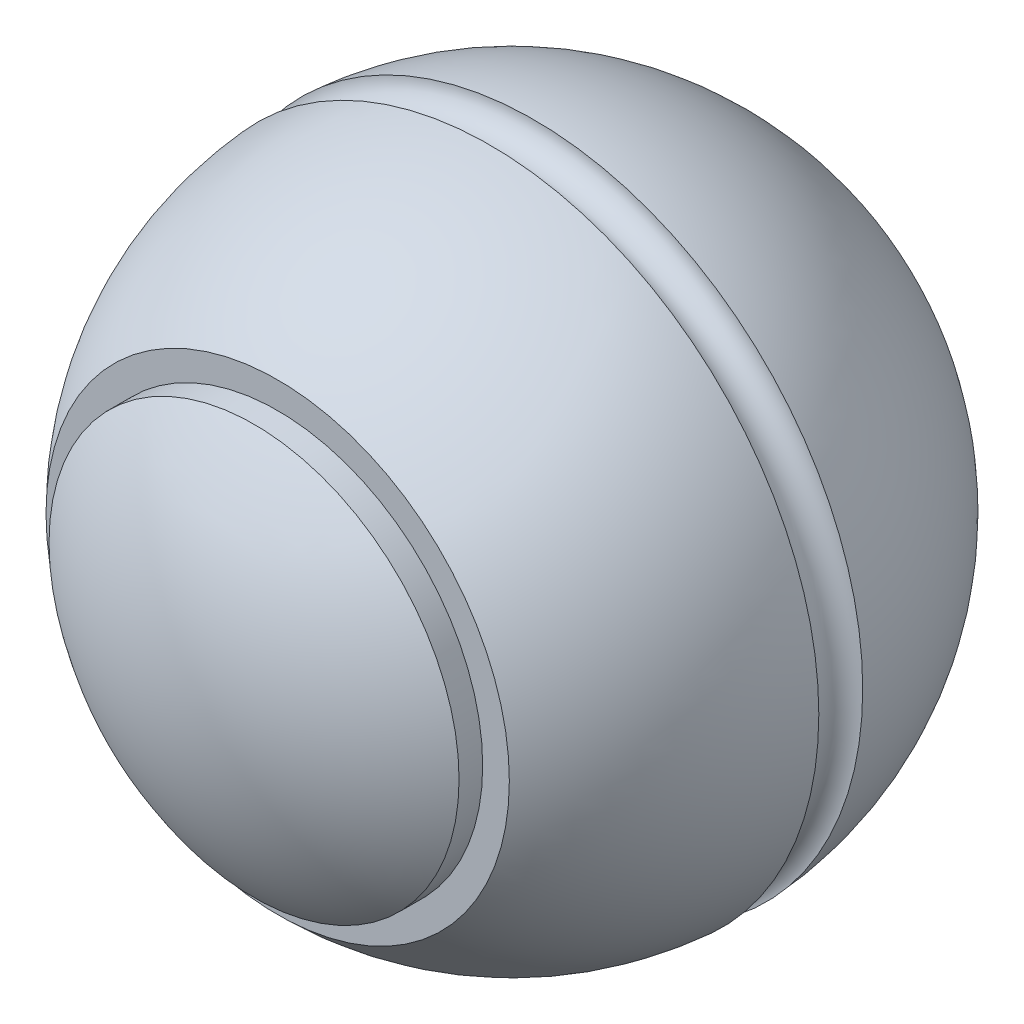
ISO-10303-21;
HEADER;
FILE_DESCRIPTION(('STEP AP214'),'2;1');
FILE_NAME('part.step','',(''),(''),'','','');
FILE_SCHEMA(('AUTOMOTIVE_DESIGN { 1 0 10303 214 1 1 1 1 }'));
ENDSEC;
DATA;
#1=APPLICATION_CONTEXT('core data for automotive mechanical design processes');
#2=APPLICATION_PROTOCOL_DEFINITION('international standard','automotive_design',2000,#1);
#3=PRODUCT_CONTEXT('',#1,'mechanical');
#4=PRODUCT('Part','Part','',(#3));
#5=PRODUCT_RELATED_PRODUCT_CATEGORY('part','',(#4));
#6=PRODUCT_DEFINITION_FORMATION('','',#4);
#7=PRODUCT_DEFINITION_CONTEXT('part definition',#1,'design');
#8=PRODUCT_DEFINITION('design','',#6,#7);
#9=PRODUCT_DEFINITION_SHAPE('','',#8);
#10=(LENGTH_UNIT() NAMED_UNIT(*) SI_UNIT(.MILLI.,.METRE.));
#11=(NAMED_UNIT(*) PLANE_ANGLE_UNIT() SI_UNIT($,.RADIAN.));
#12=(NAMED_UNIT(*) SI_UNIT($,.STERADIAN.) SOLID_ANGLE_UNIT());
#13=UNCERTAINTY_MEASURE_WITH_UNIT(LENGTH_MEASURE(1.E-05),#10,'distance_accuracy_value','');
#14=(GEOMETRIC_REPRESENTATION_CONTEXT(3) GLOBAL_UNCERTAINTY_ASSIGNED_CONTEXT((#13)) GLOBAL_UNIT_ASSIGNED_CONTEXT((#10,
#11,#12)) REPRESENTATION_CONTEXT('',''));
#15=CARTESIAN_POINT('',(0.,0.,0.));
#16=DIRECTION('',(0.,0.,1.));
#17=DIRECTION('',(1.,0.,0.));
#18=AXIS2_PLACEMENT_3D('',#15,#16,#17);
#19=CARTESIAN_POINT('',(0.,0.,19.8997487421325));
#20=DIRECTION('',(-1.,0.,0.));
#21=DIRECTION('',(0.,0.,1.));
#22=AXIS2_PLACEMENT_3D('',#19,#20,#21);
#23=SPHERICAL_SURFACE('',#22,22.5);
#24=CARTESIAN_POINT('',(0.,0.,19.8997487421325));
#25=DIRECTION('',(0.,0.,1.));
#26=DIRECTION('',(1.,0.,0.));
#27=AXIS2_PLACEMENT_3D('',#24,#25,#26);
#28=SPHERICAL_SURFACE('',#27,22.5);
#29=CARTESIAN_POINT('',(0.,0.,0.));
#30=DIRECTION('',(0.,0.,1.));
#31=DIRECTION('',(1.,0.,0.));
#32=AXIS2_PLACEMENT_3D('',#29,#30,#31);
#33=CIRCLE('',#32,10.5);
#34=CARTESIAN_POINT('',(10.5,0.,0.));
#35=VERTEX_POINT('',#34);
#36=EDGE_CURVE('E8',#35,#35,#33,.T.);
#37=ORIENTED_EDGE('',*,*,#36,.T.);
#38=EDGE_LOOP('',(#37));
#39=FACE_BOUND('',#38,.T.);
#40=CARTESIAN_POINT('',(0.,0.,18.400582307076));
#41=DIRECTION('',(0.,0.,1.));
#42=DIRECTION('',(1.,0.,0.));
#43=AXIS2_PLACEMENT_3D('',#40,#41,#42);
#44=CIRCLE('',#43,22.45);
#45=CARTESIAN_POINT('',(22.45,0.,18.400582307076));
#46=VERTEX_POINT('',#45);
#47=EDGE_CURVE('E40',#46,#46,#44,.T.);
#48=ORIENTED_EDGE('',*,*,#47,.F.);
#49=EDGE_LOOP('',(#48));
#50=FACE_BOUND('',#49,.T.);
#51=ADVANCED_FACE('F12',(#39,#50),#28,.T.);
#52=CARTESIAN_POINT('',(0.,6.,0.));
#53=DIRECTION('',(0.,0.,1.));
#54=DIRECTION('',(1.,0.,0.));
#55=AXIS2_PLACEMENT_3D('',#52,#53,#54);
#56=PLANE('',#55);
#57=ORIENTED_EDGE('',*,*,#36,.F.);
#58=EDGE_LOOP('',(#57));
#59=FACE_BOUND('',#58,.T.);
#60=CARTESIAN_POINT('',(0.,0.,0.));
#61=DIRECTION('',(0.,0.,1.));
#62=DIRECTION('',(1.,0.,0.));
#63=AXIS2_PLACEMENT_3D('',#60,#61,#62);
#64=CIRCLE('',#63,6.);
#65=CARTESIAN_POINT('',(6.,0.,0.));
#66=VERTEX_POINT('',#65);
#67=EDGE_CURVE('E18',#66,#66,#64,.T.);
#68=ORIENTED_EDGE('',*,*,#67,.T.);
#69=EDGE_LOOP('',(#68));
#70=FACE_BOUND('',#69,.T.);
#71=ADVANCED_FACE('F47',(#59,#70),#56,.F.);
#72=CARTESIAN_POINT('',(0.,0.,47.3997487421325));
#73=DIRECTION('',(0.,0.,1.));
#74=DIRECTION('',(1.,0.,0.));
#75=AXIS2_PLACEMENT_3D('',#72,#73,#74);
#76=CYLINDRICAL_SURFACE('',#75,6.);
#77=CARTESIAN_POINT('',(0.,0.,21.));
#78=DIRECTION('',(0.,0.,1.));
#79=DIRECTION('',(1.,0.,0.));
#80=AXIS2_PLACEMENT_3D('',#77,#78,#79);
#81=CIRCLE('',#80,6.);
#82=CARTESIAN_POINT('',(6.,0.,21.));
#83=VERTEX_POINT('',#82);
#84=EDGE_CURVE('E22',#83,#83,#81,.T.);
#85=ORIENTED_EDGE('',*,*,#84,.T.);
#86=EDGE_LOOP('',(#85));
#87=FACE_BOUND('',#86,.T.);
#88=ORIENTED_EDGE('',*,*,#67,.F.);
#89=EDGE_LOOP('',(#88));
#90=FACE_BOUND('',#89,.T.);
#91=ADVANCED_FACE('F53',(#87,#90),#76,.F.);
#92=CARTESIAN_POINT('',(0.,6.,21.));
#93=DIRECTION('',(0.,0.,-1.));
#94=DIRECTION('',(-1.,0.,0.));
#95=AXIS2_PLACEMENT_3D('',#92,#93,#94);
#96=PLANE('',#95);
#97=ORIENTED_EDGE('',*,*,#84,.F.);
#98=EDGE_LOOP('',(#97));
#99=FACE_BOUND('',#98,.T.);
#100=ADVANCED_FACE('F59',(#99),#96,.T.);
#101=CARTESIAN_POINT('',(0.,0.,19.8997487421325));
#102=DIRECTION('',(-1.,0.,0.));
#103=DIRECTION('',(0.,0.,1.));
#104=AXIS2_PLACEMENT_3D('',#101,#102,#103);
#105=SPHERICAL_SURFACE('',#104,22.5);
#106=CARTESIAN_POINT('',(0.,0.,19.8997487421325));
#107=DIRECTION('',(0.,0.,1.));
#108=DIRECTION('',(1.,0.,0.));
#109=AXIS2_PLACEMENT_3D('',#106,#107,#108);
#110=SPHERICAL_SURFACE('',#109,22.5);
#111=CARTESIAN_POINT('',(0.,0.,37.513663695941));
#112=DIRECTION('',(0.,0.,1.));
#113=DIRECTION('',(1.,0.,0.));
#114=AXIS2_PLACEMENT_3D('',#111,#112,#113);
#115=CIRCLE('',#114,14.);
#116=CARTESIAN_POINT('',(14.,0.,37.513663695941));
#117=VERTEX_POINT('',#116);
#118=EDGE_CURVE('E26',#117,#117,#115,.T.);
#119=ORIENTED_EDGE('',*,*,#118,.T.);
#120=EDGE_LOOP('',(#119));
#121=FACE_BOUND('',#120,.T.);
#122=ADVANCED_FACE('F65',(#121),#110,.T.);
#123=CARTESIAN_POINT('',(0.,0.,47.3997487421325));
#124=DIRECTION('',(0.,0.,1.));
#125=DIRECTION('',(1.,0.,0.));
#126=AXIS2_PLACEMENT_3D('',#123,#124,#125);
#127=CYLINDRICAL_SURFACE('',#126,14.);
#128=ORIENTED_EDGE('',*,*,#118,.F.);
#129=EDGE_LOOP('',(#128));
#130=FACE_BOUND('',#129,.T.);
#131=CARTESIAN_POINT('',(0.,0.,35.8997487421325));
#132=DIRECTION('',(0.,0.,1.));
#133=DIRECTION('',(1.,0.,0.));
#134=AXIS2_PLACEMENT_3D('',#131,#132,#133);
#135=CIRCLE('',#134,14.);
#136=CARTESIAN_POINT('',(14.,0.,35.8997487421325));
#137=VERTEX_POINT('',#136);
#138=EDGE_CURVE('E31',#137,#137,#135,.T.);
#139=ORIENTED_EDGE('',*,*,#138,.T.);
#140=EDGE_LOOP('',(#139));
#141=FACE_BOUND('',#140,.T.);
#142=ADVANCED_FACE('F69',(#130,#141),#127,.T.);
#143=CARTESIAN_POINT('',(0.,15.8192920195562,35.8997487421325));
#144=DIRECTION('',(0.,0.,-1.));
#145=DIRECTION('',(-1.,0.,0.));
#146=AXIS2_PLACEMENT_3D('',#143,#144,#145);
#147=PLANE('',#146);
#148=ORIENTED_EDGE('',*,*,#138,.F.);
#149=EDGE_LOOP('',(#148));
#150=FACE_BOUND('',#149,.T.);
#151=CARTESIAN_POINT('',(0.,0.,35.8997487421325));
#152=DIRECTION('',(0.,0.,1.));
#153=DIRECTION('',(1.,0.,0.));
#154=AXIS2_PLACEMENT_3D('',#151,#152,#153);
#155=CIRCLE('',#154,15.8192920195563);
#156=CARTESIAN_POINT('',(15.8192920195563,0.,35.8997487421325));
#157=VERTEX_POINT('',#156);
#158=EDGE_CURVE('E34',#157,#157,#155,.T.);
#159=ORIENTED_EDGE('',*,*,#158,.T.);
#160=EDGE_LOOP('',(#159));
#161=FACE_BOUND('',#160,.T.);
#162=ADVANCED_FACE('F73',(#150,#161),#147,.F.);
#163=CARTESIAN_POINT('',(0.,0.,19.8997487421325));
#164=DIRECTION('',(-1.,0.,0.));
#165=DIRECTION('',(0.,0.,1.));
#166=AXIS2_PLACEMENT_3D('',#163,#164,#165);
#167=SPHERICAL_SURFACE('',#166,22.5);
#168=CARTESIAN_POINT('',(0.,0.,19.8997487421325));
#169=DIRECTION('',(0.,0.,1.));
#170=DIRECTION('',(1.,0.,0.));
#171=AXIS2_PLACEMENT_3D('',#168,#169,#170);
#172=SPHERICAL_SURFACE('',#171,22.5);
#173=CARTESIAN_POINT('',(0.,0.,21.3989151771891));
#174=DIRECTION('',(0.,0.,1.));
#175=DIRECTION('',(1.,0.,0.));
#176=AXIS2_PLACEMENT_3D('',#173,#174,#175);
#177=CIRCLE('',#176,22.45);
#178=CARTESIAN_POINT('',(22.45,0.,21.3989151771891));
#179=VERTEX_POINT('',#178);
#180=EDGE_CURVE('E37',#179,#179,#177,.T.);
#181=ORIENTED_EDGE('',*,*,#180,.T.);
#182=EDGE_LOOP('',(#181));
#183=FACE_BOUND('',#182,.T.);
#184=ORIENTED_EDGE('',*,*,#158,.F.);
#185=EDGE_LOOP('',(#184));
#186=FACE_BOUND('',#185,.T.);
#187=ADVANCED_FACE('F77',(#183,#186),#172,.T.);
#188=CARTESIAN_POINT('',(0.,0.,19.8997487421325));
#189=DIRECTION('',(0.,0.,1.));
#190=DIRECTION('',(1.,0.,0.));
#191=AXIS2_PLACEMENT_3D('',#188,#189,#190);
#192=TOROIDAL_SURFACE('',#191,22.5,1.5);
#193=ORIENTED_EDGE('',*,*,#180,.F.);
#194=EDGE_LOOP('',(#193));
#195=FACE_BOUND('',#194,.T.);
#196=ORIENTED_EDGE('',*,*,#47,.T.);
#197=EDGE_LOOP('',(#196));
#198=FACE_BOUND('',#197,.T.);
#199=ADVANCED_FACE('F44',(#195,#198),#192,.F.);
#200=CLOSED_SHELL('',(#51,#71,#91,#100,#122,#142,#162,#187,#199));
#201=MANIFOLD_SOLID_BREP('B1',#200);
#202=ADVANCED_BREP_SHAPE_REPRESENTATION('',(#18,#201),#14);
#203=SHAPE_DEFINITION_REPRESENTATION(#9,#202);
ENDSEC;
END-ISO-10303-21;
